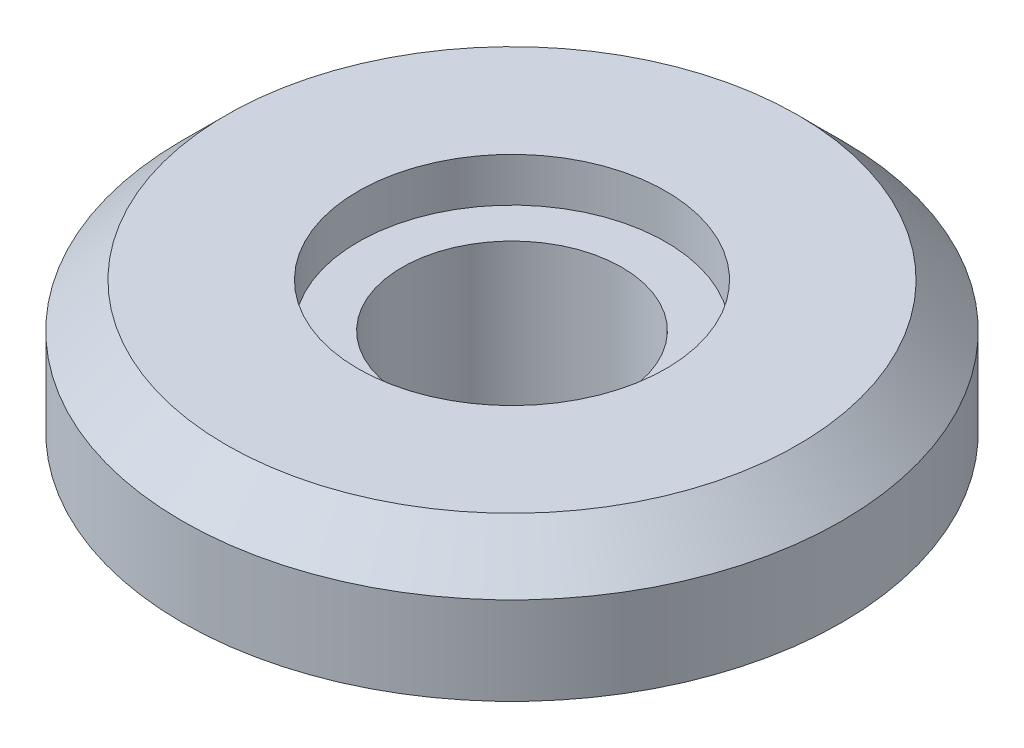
ISO-10303-21;
HEADER;
FILE_DESCRIPTION(('STEP AP214'),'2;1');
FILE_NAME('part.step','',(''),(''),'','','');
FILE_SCHEMA(('AUTOMOTIVE_DESIGN { 1 0 10303 214 1 1 1 1 }'));
ENDSEC;
DATA;
#1=APPLICATION_CONTEXT('core data for automotive mechanical design processes');
#2=APPLICATION_PROTOCOL_DEFINITION('international standard','automotive_design',2000,#1);
#3=PRODUCT_CONTEXT('',#1,'mechanical');
#4=PRODUCT('Part','Part','',(#3));
#5=PRODUCT_RELATED_PRODUCT_CATEGORY('part','',(#4));
#6=PRODUCT_DEFINITION_FORMATION('','',#4);
#7=PRODUCT_DEFINITION_CONTEXT('part definition',#1,'design');
#8=PRODUCT_DEFINITION('design','',#6,#7);
#9=PRODUCT_DEFINITION_SHAPE('','',#8);
#10=(LENGTH_UNIT() NAMED_UNIT(*) SI_UNIT(.MILLI.,.METRE.));
#11=(NAMED_UNIT(*) PLANE_ANGLE_UNIT() SI_UNIT($,.RADIAN.));
#12=(NAMED_UNIT(*) SI_UNIT($,.STERADIAN.) SOLID_ANGLE_UNIT());
#13=UNCERTAINTY_MEASURE_WITH_UNIT(LENGTH_MEASURE(1.E-05),#10,'distance_accuracy_value','');
#14=(GEOMETRIC_REPRESENTATION_CONTEXT(3) GLOBAL_UNCERTAINTY_ASSIGNED_CONTEXT((#13)) GLOBAL_UNIT_ASSIGNED_CONTEXT((#10,
#11,#12)) REPRESENTATION_CONTEXT('',''));
#15=CARTESIAN_POINT('',(0.,0.,0.));
#16=DIRECTION('',(0.,0.,1.));
#17=DIRECTION('',(1.,0.,0.));
#18=AXIS2_PLACEMENT_3D('',#15,#16,#17);
#19=CARTESIAN_POINT('',(0.,13.2766990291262,0.));
#20=DIRECTION('',(0.,1.,0.));
#21=DIRECTION('',(0.,0.,1.));
#22=AXIS2_PLACEMENT_3D('',#19,#20,#21);
#23=CYLINDRICAL_SURFACE('',#22,7.5);
#24=CARTESIAN_POINT('',(0.,5.,0.));
#25=DIRECTION('',(0.,1.,0.));
#26=DIRECTION('',(0.,0.,1.));
#27=AXIS2_PLACEMENT_3D('',#24,#25,#26);
#28=CIRCLE('',#27,7.5);
#29=CARTESIAN_POINT('',(0.,5.,7.5));
#30=VERTEX_POINT('',#29);
#31=EDGE_CURVE('E65',#30,#30,#28,.T.);
#32=ORIENTED_EDGE('',*,*,#31,.F.);
#33=EDGE_LOOP('',(#32));
#34=FACE_BOUND('',#33,.T.);
#35=CARTESIAN_POINT('',(0.,0.,0.));
#36=DIRECTION('',(0.,1.,0.));
#37=DIRECTION('',(0.,0.,1.));
#38=AXIS2_PLACEMENT_3D('',#35,#36,#37);
#39=CIRCLE('',#38,7.5);
#40=CARTESIAN_POINT('',(0.,0.,7.5));
#41=VERTEX_POINT('',#40);
#42=EDGE_CURVE('E10',#41,#41,#39,.T.);
#43=ORIENTED_EDGE('',*,*,#42,.T.);
#44=EDGE_LOOP('',(#43));
#45=FACE_BOUND('',#44,.T.);
#46=ADVANCED_FACE('F34',(#34,#45),#23,.T.);
#47=CARTESIAN_POINT('',(5.,0.,0.));
#48=DIRECTION('',(0.,1.,0.));
#49=DIRECTION('',(0.,0.,1.));
#50=AXIS2_PLACEMENT_3D('',#47,#48,#49);
#51=PLANE('',#50);
#52=ORIENTED_EDGE('',*,*,#42,.F.);
#53=EDGE_LOOP('',(#52));
#54=FACE_BOUND('',#53,.T.);
#55=CARTESIAN_POINT('',(0.,0.,0.));
#56=DIRECTION('',(0.,1.,0.));
#57=DIRECTION('',(0.,0.,1.));
#58=AXIS2_PLACEMENT_3D('',#55,#56,#57);
#59=CIRCLE('',#58,5.);
#60=CARTESIAN_POINT('',(0.,0.,5.));
#61=VERTEX_POINT('',#60);
#62=EDGE_CURVE('E40',#61,#61,#59,.T.);
#63=ORIENTED_EDGE('',*,*,#62,.T.);
#64=EDGE_LOOP('',(#63));
#65=FACE_BOUND('',#64,.T.);
#66=ADVANCED_FACE('F72',(#54,#65),#51,.F.);
#67=CARTESIAN_POINT('',(0.,13.2766990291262,0.));
#68=DIRECTION('',(0.,1.,0.));
#69=DIRECTION('',(0.,0.,1.));
#70=AXIS2_PLACEMENT_3D('',#67,#68,#69);
#71=CYLINDRICAL_SURFACE('',#70,5.);
#72=ORIENTED_EDGE('',*,*,#62,.F.);
#73=EDGE_LOOP('',(#72));
#74=FACE_BOUND('',#73,.T.);
#75=CARTESIAN_POINT('',(0.,9.,0.));
#76=DIRECTION('',(0.,1.,0.));
#77=DIRECTION('',(0.,0.,1.));
#78=AXIS2_PLACEMENT_3D('',#75,#76,#77);
#79=CIRCLE('',#78,5.);
#80=CARTESIAN_POINT('',(0.,9.,5.));
#81=VERTEX_POINT('',#80);
#82=EDGE_CURVE('E44',#81,#81,#79,.T.);
#83=ORIENTED_EDGE('',*,*,#82,.T.);
#84=EDGE_LOOP('',(#83));
#85=FACE_BOUND('',#84,.T.);
#86=ADVANCED_FACE('F76',(#74,#85),#71,.F.);
#87=CARTESIAN_POINT('',(7.,9.,0.));
#88=DIRECTION('',(0.,-1.,0.));
#89=DIRECTION('',(0.,0.,-1.));
#90=AXIS2_PLACEMENT_3D('',#87,#88,#89);
#91=PLANE('',#90);
#92=ORIENTED_EDGE('',*,*,#82,.F.);
#93=EDGE_LOOP('',(#92));
#94=FACE_BOUND('',#93,.T.);
#95=CARTESIAN_POINT('',(0.,9.,0.));
#96=DIRECTION('',(0.,1.,0.));
#97=DIRECTION('',(0.,0.,1.));
#98=AXIS2_PLACEMENT_3D('',#95,#96,#97);
#99=CIRCLE('',#98,7.);
#100=CARTESIAN_POINT('',(0.,9.,7.));
#101=VERTEX_POINT('',#100);
#102=EDGE_CURVE('E48',#101,#101,#99,.T.);
#103=ORIENTED_EDGE('',*,*,#102,.T.);
#104=EDGE_LOOP('',(#103));
#105=FACE_BOUND('',#104,.T.);
#106=ADVANCED_FACE('F81',(#94,#105),#91,.F.);
#107=CARTESIAN_POINT('',(0.,13.2766990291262,0.));
#108=DIRECTION('',(0.,1.,0.));
#109=DIRECTION('',(0.,0.,1.));
#110=AXIS2_PLACEMENT_3D('',#107,#108,#109);
#111=CYLINDRICAL_SURFACE('',#110,7.);
#112=ORIENTED_EDGE('',*,*,#102,.F.);
#113=EDGE_LOOP('',(#112));
#114=FACE_BOUND('',#113,.T.);
#115=CARTESIAN_POINT('',(0.,11.,0.));
#116=DIRECTION('',(0.,1.,0.));
#117=DIRECTION('',(0.,0.,1.));
#118=AXIS2_PLACEMENT_3D('',#115,#116,#117);
#119=CIRCLE('',#118,7.);
#120=CARTESIAN_POINT('',(0.,11.,7.));
#121=VERTEX_POINT('',#120);
#122=EDGE_CURVE('E53',#121,#121,#119,.T.);
#123=ORIENTED_EDGE('',*,*,#122,.T.);
#124=EDGE_LOOP('',(#123));
#125=FACE_BOUND('',#124,.T.);
#126=ADVANCED_FACE('F87',(#114,#125),#111,.F.);
#127=CARTESIAN_POINT('',(13.,11.,0.));
#128=DIRECTION('',(0.,-1.,0.));
#129=DIRECTION('',(0.,0.,-1.));
#130=AXIS2_PLACEMENT_3D('',#127,#128,#129);
#131=PLANE('',#130);
#132=ORIENTED_EDGE('',*,*,#122,.F.);
#133=EDGE_LOOP('',(#132));
#134=FACE_BOUND('',#133,.T.);
#135=CARTESIAN_POINT('',(0.,11.,0.));
#136=DIRECTION('',(0.,1.,0.));
#137=DIRECTION('',(0.,0.,1.));
#138=AXIS2_PLACEMENT_3D('',#135,#136,#137);
#139=CIRCLE('',#138,13.);
#140=CARTESIAN_POINT('',(0.,11.,13.));
#141=VERTEX_POINT('',#140);
#142=EDGE_CURVE('E56',#141,#141,#139,.T.);
#143=ORIENTED_EDGE('',*,*,#142,.T.);
#144=EDGE_LOOP('',(#143));
#145=FACE_BOUND('',#144,.T.);
#146=ADVANCED_FACE('F91',(#134,#145),#131,.F.);
#147=CARTESIAN_POINT('',(0.,9.,0.));
#148=DIRECTION('',(0.,-1.,0.));
#149=DIRECTION('',(0.,0.,-1.));
#150=AXIS2_PLACEMENT_3D('',#147,#148,#149);
#151=CONICAL_SURFACE('',#150,15.,0.785398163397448);
#152=ORIENTED_EDGE('',*,*,#142,.F.);
#153=EDGE_LOOP('',(#152));
#154=FACE_BOUND('',#153,.T.);
#155=CARTESIAN_POINT('',(0.,9.,0.));
#156=DIRECTION('',(0.,1.,0.));
#157=DIRECTION('',(0.,0.,1.));
#158=AXIS2_PLACEMENT_3D('',#155,#156,#157);
#159=CIRCLE('',#158,15.);
#160=CARTESIAN_POINT('',(0.,9.,15.));
#161=VERTEX_POINT('',#160);
#162=EDGE_CURVE('E59',#161,#161,#159,.T.);
#163=ORIENTED_EDGE('',*,*,#162,.T.);
#164=EDGE_LOOP('',(#163));
#165=FACE_BOUND('',#164,.T.);
#166=ADVANCED_FACE('F95',(#154,#165),#151,.T.);
#167=CARTESIAN_POINT('',(0.,13.2766990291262,0.));
#168=DIRECTION('',(0.,1.,0.));
#169=DIRECTION('',(0.,0.,1.));
#170=AXIS2_PLACEMENT_3D('',#167,#168,#169);
#171=CYLINDRICAL_SURFACE('',#170,15.);
#172=ORIENTED_EDGE('',*,*,#162,.F.);
#173=EDGE_LOOP('',(#172));
#174=FACE_BOUND('',#173,.T.);
#175=CARTESIAN_POINT('',(0.,5.,0.));
#176=DIRECTION('',(0.,1.,0.));
#177=DIRECTION('',(0.,0.,1.));
#178=AXIS2_PLACEMENT_3D('',#175,#176,#177);
#179=CIRCLE('',#178,15.);
#180=CARTESIAN_POINT('',(0.,5.,15.));
#181=VERTEX_POINT('',#180);
#182=EDGE_CURVE('E62',#181,#181,#179,.T.);
#183=ORIENTED_EDGE('',*,*,#182,.T.);
#184=EDGE_LOOP('',(#183));
#185=FACE_BOUND('',#184,.T.);
#186=ADVANCED_FACE('F99',(#174,#185),#171,.T.);
#187=CARTESIAN_POINT('',(7.5,5.,0.));
#188=DIRECTION('',(0.,1.,0.));
#189=DIRECTION('',(0.,0.,1.));
#190=AXIS2_PLACEMENT_3D('',#187,#188,#189);
#191=PLANE('',#190);
#192=ORIENTED_EDGE('',*,*,#182,.F.);
#193=EDGE_LOOP('',(#192));
#194=FACE_BOUND('',#193,.T.);
#195=ORIENTED_EDGE('',*,*,#31,.T.);
#196=EDGE_LOOP('',(#195));
#197=FACE_BOUND('',#196,.T.);
#198=ADVANCED_FACE('F69',(#194,#197),#191,.F.);
#199=CLOSED_SHELL('',(#46,#66,#86,#106,#126,#146,#166,#186,#198));
#200=MANIFOLD_SOLID_BREP('B2',#199);
#201=ADVANCED_BREP_SHAPE_REPRESENTATION('',(#18,#200),#14);
#202=SHAPE_DEFINITION_REPRESENTATION(#9,#201);
ENDSEC;
END-ISO-10303-21;
